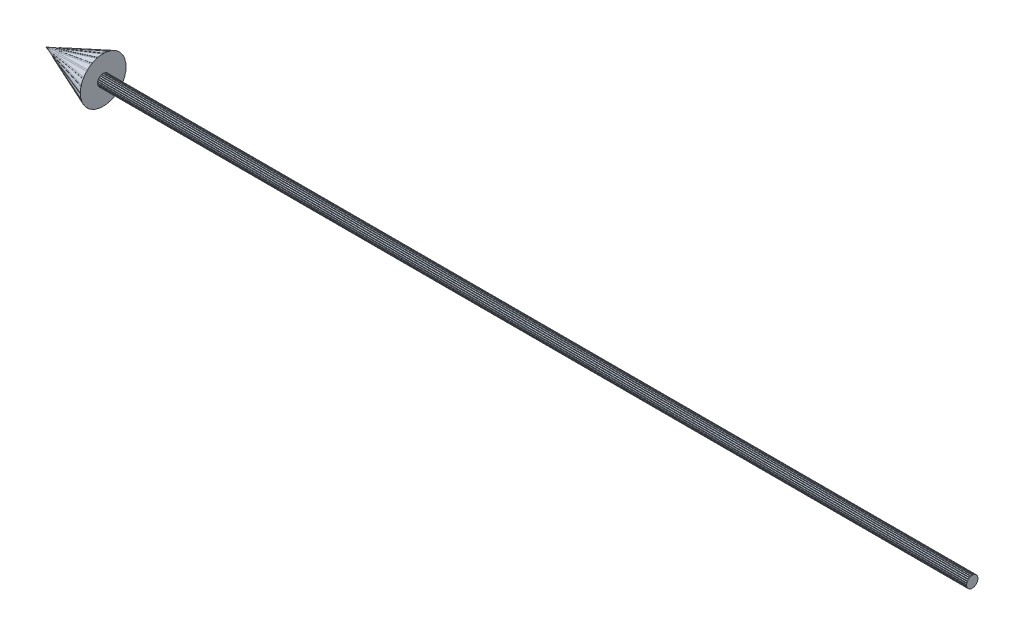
from build123d import *

# Parameters (mm, degrees)
ESQUISSE1_R                  = 0.5
BOSS_EXTRU_1_DEPTH           = 75.96
ENL_V_MAT_EXTRU_1_DEPTH      = 75.96
R_P_TITION_CIRCULAIRE1_COUNT = 24
ENL_V_MAT_EXTRU_2_DEPTH      = 0.05
R_P_TITION_CIRCULAIRE2_COUNT = 24


with BuildPart() as part:
    # Esquisse1 → Boss.-Extru.1 (new body)
    with BuildSketch(Plane(origin=(0, 0, 0), x_dir=(0, 0, -1), z_dir=(1, 0, 0))):
        Circle(ESQUISSE1_R)
    extrude(amount=BOSS_EXTRU_1_DEPTH)

    # Esquisse2 → R_volution1 (revolve)
    with BuildSketch(Plane.XY, mode=Mode.PRIVATE) as r_volution1_sk:
        Polygon((0, 0), (0, 2), (-5, 0), align=None)
    revolve(r_volution1_sk.sketch.rotate(Axis((0, 0, 0), (-1, 0, 0)), 90), axis=Axis((0, 0, 0), (-1, 0, 0)))

    # Esquisse3 → Enl_v. mat.-Extru.1 (cut)
    with BuildSketch(Plane(origin=(75.96, 0, 0), x_dir=(0, 0, -1), z_dir=(1, 0, 0))):
        Polygon((0, 0.48), (-0.05, 0.53), (0.05, 0.53), align=None)
    enl_v_mat_extru_1 = extrude(amount=-ENL_V_MAT_EXTRU_1_DEPTH, mode=Mode.SUBTRACT)

    # R_p_tition circulaire1: Enl_v. mat.-Extru.1 ×24 about axis
    r_p_tition_circulaire1_axis = Axis((0, 0, 0), (1, 0, 0))
    for i in range(1, R_P_TITION_CIRCULAIRE1_COUNT):
        add(enl_v_mat_extru_1.rotate(r_p_tition_circulaire1_axis, i * 360 / R_P_TITION_CIRCULAIRE1_COUNT), mode=Mode.SUBTRACT)

    # Esquisse4 → Enl_v. mat.-Extru.2 (cut, symmetric)
    with BuildSketch(Plane.XY):
        Polygon((0, 1.978459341), (-4.772110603, 0.0696151), (-4.825962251, 0.0696151), (0, 2), align=None)
    enl_v_mat_extru_2 = extrude(amount=ENL_V_MAT_EXTRU_2_DEPTH, both=True, mode=Mode.SUBTRACT)

    # R_p_tition circulaire2: Enl_v. mat.-Extru.2 ×24 about axis
    r_p_tition_circulaire2_axis = Axis((0, 0, 0), (1, 0, 0))
    for i in range(1, R_P_TITION_CIRCULAIRE2_COUNT):
        add(enl_v_mat_extru_2.rotate(r_p_tition_circulaire2_axis, i * 360 / R_P_TITION_CIRCULAIRE2_COUNT), mode=Mode.SUBTRACT)


solid = part.part
